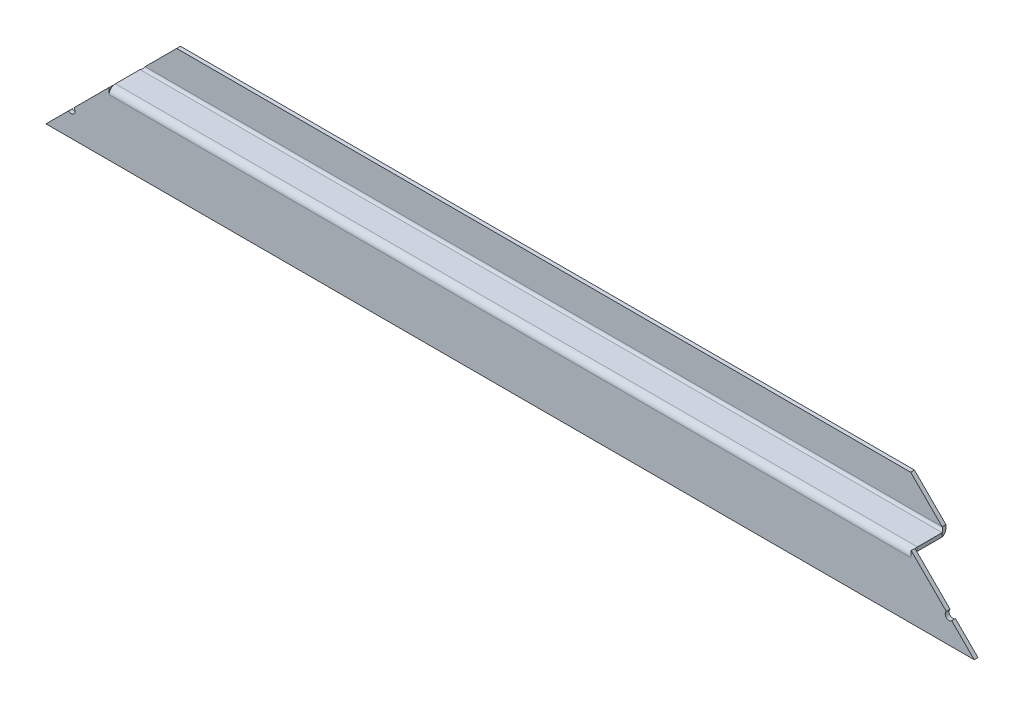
ISO-10303-21;
HEADER;
FILE_DESCRIPTION(('STEP AP214'),'2;1');
FILE_NAME('part.step','',(''),(''),'','','');
FILE_SCHEMA(('AUTOMOTIVE_DESIGN { 1 0 10303 214 1 1 1 1 }'));
ENDSEC;
DATA;
#1=APPLICATION_CONTEXT('core data for automotive mechanical design processes');
#2=APPLICATION_PROTOCOL_DEFINITION('international standard','automotive_design',2000,#1);
#3=PRODUCT_CONTEXT('',#1,'mechanical');
#4=PRODUCT('Part','Part','',(#3));
#5=PRODUCT_RELATED_PRODUCT_CATEGORY('part','',(#4));
#6=PRODUCT_DEFINITION_FORMATION('','',#4);
#7=PRODUCT_DEFINITION_CONTEXT('part definition',#1,'design');
#8=PRODUCT_DEFINITION('design','',#6,#7);
#9=PRODUCT_DEFINITION_SHAPE('','',#8);
#10=(LENGTH_UNIT() NAMED_UNIT(*) SI_UNIT(.MILLI.,.METRE.));
#11=(NAMED_UNIT(*) PLANE_ANGLE_UNIT() SI_UNIT($,.RADIAN.));
#12=(NAMED_UNIT(*) SI_UNIT($,.STERADIAN.) SOLID_ANGLE_UNIT());
#13=UNCERTAINTY_MEASURE_WITH_UNIT(LENGTH_MEASURE(1.E-05),#10,'distance_accuracy_value','');
#14=(GEOMETRIC_REPRESENTATION_CONTEXT(3) GLOBAL_UNCERTAINTY_ASSIGNED_CONTEXT((#13)) GLOBAL_UNIT_ASSIGNED_CONTEXT((#10,
#11,#12)) REPRESENTATION_CONTEXT('',''));
#15=CARTESIAN_POINT('',(0.,0.,0.));
#16=DIRECTION('',(0.,0.,1.));
#17=DIRECTION('',(1.,0.,0.));
#18=AXIS2_PLACEMENT_3D('',#15,#16,#17);
#19=CARTESIAN_POINT('',(-159.,-703.,1.5));
#20=DIRECTION('',(0.707106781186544,-0.707106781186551,0.));
#21=DIRECTION('',(0.707106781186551,0.707106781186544,0.));
#22=AXIS2_PLACEMENT_3D('',#19,#20,#21);
#23=PLANE('',#22);
#24=DIRECTION('',(-0.707106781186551,-0.707106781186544,0.));
#25=VECTOR('',#24,1.);
#26=CARTESIAN_POINT('',(-159.,-703.,0.));
#27=LINE('',#26,#25);
#28=CARTESIAN_POINT('',(-159.,-703.,0.));
#29=VERTEX_POINT('',#28);
#30=CARTESIAN_POINT('',(-172.93933982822,-716.93933982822,0.));
#31=VERTEX_POINT('',#30);
#32=EDGE_CURVE('E237',#29,#31,#27,.T.);
#33=ORIENTED_EDGE('',*,*,#32,.T.);
#34=DIRECTION('',(0.,0.,1.));
#35=VECTOR('',#34,1.);
#36=CARTESIAN_POINT('',(-172.93933982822,-716.93933982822,0.));
#37=LINE('',#36,#35);
#38=CARTESIAN_POINT('',(-172.93933982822,-716.93933982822,1.5));
#39=VERTEX_POINT('',#38);
#40=EDGE_CURVE('E13',#31,#39,#37,.T.);
#41=ORIENTED_EDGE('',*,*,#40,.T.);
#42=DIRECTION('',(-0.707106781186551,-0.707106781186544,0.));
#43=VECTOR('',#42,1.);
#44=CARTESIAN_POINT('',(-159.,-703.,1.5));
#45=LINE('',#44,#43);
#46=CARTESIAN_POINT('',(-159.,-703.,1.5));
#47=VERTEX_POINT('',#46);
#48=EDGE_CURVE('E233',#47,#39,#45,.T.);
#49=ORIENTED_EDGE('',*,*,#48,.F.);
#50=DIRECTION('',(0.,0.,-1.));
#51=VECTOR('',#50,1.);
#52=CARTESIAN_POINT('',(-159.,-703.,1.5));
#53=LINE('',#52,#51);
#54=EDGE_CURVE('E232',#47,#29,#53,.T.);
#55=ORIENTED_EDGE('',*,*,#54,.T.);
#56=EDGE_LOOP('',(#33,#41,#49,#55));
#57=FACE_BOUND('',#56,.T.);
#58=ADVANCED_FACE('F78',(#57),#23,.F.);
#59=CARTESIAN_POINT('',(158.999999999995,-703.,1.5));
#60=DIRECTION('',(-0.707106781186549,-0.707106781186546,0.));
#61=DIRECTION('',(0.707106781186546,-0.707106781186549,0.));
#62=AXIS2_PLACEMENT_3D('',#59,#60,#61);
#63=PLANE('',#62);
#64=DIRECTION('',(-0.707106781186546,0.707106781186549,0.));
#65=VECTOR('',#64,1.);
#66=CARTESIAN_POINT('',(158.999999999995,-703.,0.));
#67=LINE('',#66,#65);
#68=CARTESIAN_POINT('',(183.999999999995,-728.,0.));
#69=VERTEX_POINT('',#68);
#70=CARTESIAN_POINT('',(175.060660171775,-719.06066017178,0.));
#71=VERTEX_POINT('',#70);
#72=EDGE_CURVE('E244',#69,#71,#67,.T.);
#73=ORIENTED_EDGE('',*,*,#72,.T.);
#74=DIRECTION('',(0.,0.,1.));
#75=VECTOR('',#74,1.);
#76=CARTESIAN_POINT('',(175.060660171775,-719.06066017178,0.));
#77=LINE('',#76,#75);
#78=CARTESIAN_POINT('',(175.060660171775,-719.06066017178,1.5));
#79=VERTEX_POINT('',#78);
#80=EDGE_CURVE('E214',#71,#79,#77,.T.);
#81=ORIENTED_EDGE('',*,*,#80,.T.);
#82=DIRECTION('',(-0.707106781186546,0.707106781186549,0.));
#83=VECTOR('',#82,1.);
#84=CARTESIAN_POINT('',(158.999999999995,-703.,1.5));
#85=LINE('',#84,#83);
#86=CARTESIAN_POINT('',(183.999999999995,-728.,1.5));
#87=VERTEX_POINT('',#86);
#88=EDGE_CURVE('E224',#87,#79,#85,.T.);
#89=ORIENTED_EDGE('',*,*,#88,.F.);
#90=DIRECTION('',(0.,0.,-1.));
#91=VECTOR('',#90,1.);
#92=CARTESIAN_POINT('',(183.999999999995,-728.,1.5));
#93=LINE('',#92,#91);
#94=EDGE_CURVE('E251',#87,#69,#93,.T.);
#95=ORIENTED_EDGE('',*,*,#94,.T.);
#96=EDGE_LOOP('',(#73,#81,#89,#95));
#97=FACE_BOUND('',#96,.T.);
#98=ADVANCED_FACE('F282',(#97),#63,.F.);
#99=CARTESIAN_POINT('',(-159.,-703.,-13.3));
#100=DIRECTION('',(-1.,0.,0.));
#101=DIRECTION('',(0.,0.,1.));
#102=AXIS2_PLACEMENT_3D('',#99,#100,#101);
#103=PLANE('',#102);
#104=DIRECTION('',(0.,0.,-1.));
#105=VECTOR('',#104,1.);
#106=CARTESIAN_POINT('',(-159.,-703.,-13.3));
#107=LINE('',#106,#105);
#108=CARTESIAN_POINT('',(-159.,-703.,-1.));
#109=VERTEX_POINT('',#108);
#110=CARTESIAN_POINT('',(-159.,-703.,-10.8));
#111=VERTEX_POINT('',#110);
#112=EDGE_CURVE('E498',#109,#111,#107,.T.);
#113=ORIENTED_EDGE('',*,*,#112,.T.);
#114=DIRECTION('',(0.,-1.,0.));
#115=VECTOR('',#114,1.);
#116=CARTESIAN_POINT('',(-159.,-703.,-10.8));
#117=LINE('',#116,#115);
#118=CARTESIAN_POINT('',(-159.,-704.5,-10.8));
#119=VERTEX_POINT('',#118);
#120=EDGE_CURVE('E331',#111,#119,#117,.T.);
#121=ORIENTED_EDGE('',*,*,#120,.T.);
#122=DIRECTION('',(0.,0.,1.));
#123=VECTOR('',#122,1.);
#124=CARTESIAN_POINT('',(-159.,-704.5,0.));
#125=LINE('',#124,#123);
#126=CARTESIAN_POINT('',(-159.,-704.5,-1.));
#127=VERTEX_POINT('',#126);
#128=EDGE_CURVE('E495',#127,#119,#125,.F.);
#129=ORIENTED_EDGE('',*,*,#128,.F.);
#130=DIRECTION('',(0.,1.,0.));
#131=VECTOR('',#130,1.);
#132=CARTESIAN_POINT('',(-159.,-703.,-1.));
#133=LINE('',#132,#131);
#134=EDGE_CURVE('E330',#127,#109,#133,.T.);
#135=ORIENTED_EDGE('',*,*,#134,.T.);
#136=EDGE_LOOP('',(#113,#121,#129,#135));
#137=FACE_BOUND('',#136,.T.);
#138=ADVANCED_FACE('F395',(#137),#103,.T.);
#139=CARTESIAN_POINT('',(0.,-703.,0.));
#140=DIRECTION('',(0.,1.,0.));
#141=DIRECTION('',(0.,0.,1.));
#142=AXIS2_PLACEMENT_3D('',#139,#140,#141);
#143=PLANE('',#142);
#144=DIRECTION('',(0.,0.,1.));
#145=VECTOR('',#144,1.);
#146=CARTESIAN_POINT('',(158.999999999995,-703.,0.));
#147=LINE('',#146,#145);
#148=CARTESIAN_POINT('',(158.999999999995,-703.,-10.8));
#149=VERTEX_POINT('',#148);
#150=CARTESIAN_POINT('',(158.999999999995,-703.,-1.));
#151=VERTEX_POINT('',#150);
#152=EDGE_CURVE('E377',#149,#151,#147,.T.);
#153=ORIENTED_EDGE('',*,*,#152,.F.);
#154=DIRECTION('',(-1.,0.,0.));
#155=VECTOR('',#154,1.);
#156=CARTESIAN_POINT('',(-159.,-703.,-10.8));
#157=LINE('',#156,#155);
#158=EDGE_CURVE('E319',#111,#149,#157,.F.);
#159=ORIENTED_EDGE('',*,*,#158,.F.);
#160=ORIENTED_EDGE('',*,*,#112,.F.);
#161=DIRECTION('',(1.,0.,0.));
#162=VECTOR('',#161,1.);
#163=CARTESIAN_POINT('',(0.,-703.,-1.));
#164=LINE('',#163,#162);
#165=EDGE_CURVE('E464',#109,#151,#164,.T.);
#166=ORIENTED_EDGE('',*,*,#165,.T.);
#167=EDGE_LOOP('',(#153,#159,#160,#166));
#168=FACE_BOUND('',#167,.T.);
#169=ADVANCED_FACE('F385',(#168),#143,.T.);
#170=CARTESIAN_POINT('',(0.,-704.5,0.));
#171=DIRECTION('',(0.,1.,0.));
#172=DIRECTION('',(0.,0.,1.));
#173=AXIS2_PLACEMENT_3D('',#170,#171,#172);
#174=PLANE('',#173);
#175=DIRECTION('',(-1.,0.,0.));
#176=VECTOR('',#175,1.);
#177=CARTESIAN_POINT('',(-159.,-704.5,-10.8));
#178=LINE('',#177,#176);
#179=CARTESIAN_POINT('',(158.999999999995,-704.5,-10.8));
#180=VERTEX_POINT('',#179);
#181=EDGE_CURVE('E323',#119,#180,#178,.F.);
#182=ORIENTED_EDGE('',*,*,#181,.T.);
#183=DIRECTION('',(0.,0.,-1.));
#184=VECTOR('',#183,1.);
#185=CARTESIAN_POINT('',(158.999999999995,-704.5,0.));
#186=LINE('',#185,#184);
#187=CARTESIAN_POINT('',(158.999999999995,-704.5,-1.));
#188=VERTEX_POINT('',#187);
#189=EDGE_CURVE('E497',#180,#188,#186,.F.);
#190=ORIENTED_EDGE('',*,*,#189,.T.);
#191=DIRECTION('',(-1.,0.,0.));
#192=VECTOR('',#191,1.);
#193=CARTESIAN_POINT('',(-159.,-704.5,-1.));
#194=LINE('',#193,#192);
#195=EDGE_CURVE('E487',#127,#188,#194,.F.);
#196=ORIENTED_EDGE('',*,*,#195,.F.);
#197=ORIENTED_EDGE('',*,*,#128,.T.);
#198=EDGE_LOOP('',(#182,#190,#196,#197));
#199=FACE_BOUND('',#198,.T.);
#200=ADVANCED_FACE('F394',(#199),#174,.F.);
#201=CARTESIAN_POINT('',(158.999999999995,-703.,0.));
#202=DIRECTION('',(-1.,0.,0.));
#203=DIRECTION('',(0.,-1.,0.));
#204=AXIS2_PLACEMENT_3D('',#201,#202,#203);
#205=PLANE('',#204);
#206=DIRECTION('',(0.,-1.,0.));
#207=VECTOR('',#206,1.);
#208=CARTESIAN_POINT('',(158.999999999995,-703.,0.));
#209=LINE('',#208,#207);
#210=CARTESIAN_POINT('',(158.999999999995,-703.,0.));
#211=VERTEX_POINT('',#210);
#212=CARTESIAN_POINT('',(158.999999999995,-703.208712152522,0.));
#213=VERTEX_POINT('',#212);
#214=EDGE_CURVE('E271',#211,#213,#209,.T.);
#215=ORIENTED_EDGE('',*,*,#214,.T.);
#216=CARTESIAN_POINT('',(158.999999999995,-705.5,-1.));
#217=DIRECTION('',(1.,0.,0.));
#218=DIRECTION('',(0.,0.,-1.));
#219=AXIS2_PLACEMENT_3D('',#216,#217,#218);
#220=CIRCLE('',#219,2.5);
#221=CARTESIAN_POINT('',(158.999999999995,-705.5,1.5));
#222=VERTEX_POINT('',#221);
#223=EDGE_CURVE('E215',#213,#222,#220,.T.);
#224=ORIENTED_EDGE('',*,*,#223,.T.);
#225=DIRECTION('',(0.,-1.,0.));
#226=VECTOR('',#225,1.);
#227=CARTESIAN_POINT('',(158.999999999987,1.7652546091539E-12,1.5));
#228=LINE('',#227,#226);
#229=CARTESIAN_POINT('',(158.999999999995,-703.,1.5));
#230=VERTEX_POINT('',#229);
#231=EDGE_CURVE('E267',#230,#222,#228,.T.);
#232=ORIENTED_EDGE('',*,*,#231,.F.);
#233=DIRECTION('',(0.,0.,-1.));
#234=VECTOR('',#233,1.);
#235=CARTESIAN_POINT('',(158.999999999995,-703.,1.5));
#236=LINE('',#235,#234);
#237=EDGE_CURVE('E228',#230,#211,#236,.T.);
#238=ORIENTED_EDGE('',*,*,#237,.T.);
#239=EDGE_LOOP('',(#215,#224,#232,#238));
#240=FACE_BOUND('',#239,.T.);
#241=ADVANCED_FACE('F399',(#240),#205,.T.);
#242=CARTESIAN_POINT('',(-159.,-705.5,0.));
#243=DIRECTION('',(1.,0.,0.));
#244=DIRECTION('',(0.,0.,-1.));
#245=AXIS2_PLACEMENT_3D('',#242,#243,#244);
#246=PLANE('',#245);
#247=DIRECTION('',(0.,1.,0.));
#248=VECTOR('',#247,1.);
#249=CARTESIAN_POINT('',(-159.,0.,1.5));
#250=LINE('',#249,#248);
#251=CARTESIAN_POINT('',(-159.,-705.5,1.5));
#252=VERTEX_POINT('',#251);
#253=EDGE_CURVE('E268',#252,#47,#250,.T.);
#254=ORIENTED_EDGE('',*,*,#253,.F.);
#255=CARTESIAN_POINT('',(-159.,-705.5,-1.));
#256=DIRECTION('',(1.,0.,0.));
#257=DIRECTION('',(0.,0.,-1.));
#258=AXIS2_PLACEMENT_3D('',#255,#256,#257);
#259=CIRCLE('',#258,2.5);
#260=CARTESIAN_POINT('',(-159.,-703.208712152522,0.));
#261=VERTEX_POINT('',#260);
#262=EDGE_CURVE('E451',#252,#261,#259,.F.);
#263=ORIENTED_EDGE('',*,*,#262,.T.);
#264=DIRECTION('',(0.,1.,0.));
#265=VECTOR('',#264,1.);
#266=CARTESIAN_POINT('',(-159.,-705.5,0.));
#267=LINE('',#266,#265);
#268=EDGE_CURVE('E446',#261,#29,#267,.T.);
#269=ORIENTED_EDGE('',*,*,#268,.T.);
#270=ORIENTED_EDGE('',*,*,#54,.F.);
#271=EDGE_LOOP('',(#254,#263,#269,#270));
#272=FACE_BOUND('',#271,.T.);
#273=ADVANCED_FACE('F424',(#272),#246,.T.);
#274=CARTESIAN_POINT('',(0.,0.,1.5));
#275=DIRECTION('',(0.,0.,1.));
#276=DIRECTION('',(1.,0.,0.));
#277=AXIS2_PLACEMENT_3D('',#274,#275,#276);
#278=PLANE('',#277);
#279=CARTESIAN_POINT('',(173.999999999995,-718.,1.5));
#280=DIRECTION('',(0.,0.,1.));
#281=DIRECTION('',(1.,0.,0.));
#282=AXIS2_PLACEMENT_3D('',#279,#280,#281);
#283=CIRCLE('',#282,1.50000000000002);
#284=CARTESIAN_POINT('',(172.939339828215,-716.93933982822,1.5));
#285=VERTEX_POINT('',#284);
#286=EDGE_CURVE('E209',#285,#79,#283,.T.);
#287=ORIENTED_EDGE('',*,*,#286,.F.);
#288=EDGE_CURVE('E221',#285,#230,#85,.T.);
#289=ORIENTED_EDGE('',*,*,#288,.T.);
#290=ORIENTED_EDGE('',*,*,#231,.T.);
#291=DIRECTION('',(1.,0.,0.));
#292=VECTOR('',#291,1.);
#293=CARTESIAN_POINT('',(158.999999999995,-705.5,1.5));
#294=LINE('',#293,#292);
#295=EDGE_CURVE('E466',#222,#252,#294,.F.);
#296=ORIENTED_EDGE('',*,*,#295,.T.);
#297=ORIENTED_EDGE('',*,*,#253,.T.);
#298=ORIENTED_EDGE('',*,*,#48,.T.);
#299=CARTESIAN_POINT('',(-174.,-718.,1.5));
#300=DIRECTION('',(0.,0.,1.));
#301=DIRECTION('',(1.,0.,0.));
#302=AXIS2_PLACEMENT_3D('',#299,#300,#301);
#303=CIRCLE('',#302,1.5);
#304=CARTESIAN_POINT('',(-175.06066017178,-719.06066017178,1.5));
#305=VERTEX_POINT('',#304);
#306=EDGE_CURVE('E278',#305,#39,#303,.T.);
#307=ORIENTED_EDGE('',*,*,#306,.F.);
#308=CARTESIAN_POINT('',(-184.,-728.,1.5));
#309=VERTEX_POINT('',#308);
#310=EDGE_CURVE('E247',#305,#309,#45,.T.);
#311=ORIENTED_EDGE('',*,*,#310,.T.);
#312=DIRECTION('',(1.,0.,0.));
#313=VECTOR('',#312,1.);
#314=CARTESIAN_POINT('',(-184.,-728.,1.5));
#315=LINE('',#314,#313);
#316=EDGE_CURVE('E230',#309,#87,#315,.T.);
#317=ORIENTED_EDGE('',*,*,#316,.T.);
#318=ORIENTED_EDGE('',*,*,#88,.T.);
#319=EDGE_LOOP('',(#287,#289,#290,#296,#297,#298,#307,#311,#317,#318));
#320=FACE_BOUND('',#319,.T.);
#321=ADVANCED_FACE('F219',(#320),#278,.T.);
#322=CARTESIAN_POINT('',(0.,0.,0.));
#323=DIRECTION('',(0.,0.,1.));
#324=DIRECTION('',(1.,0.,0.));
#325=AXIS2_PLACEMENT_3D('',#322,#323,#324);
#326=PLANE('',#325);
#327=CARTESIAN_POINT('',(172.939339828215,-716.93933982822,0.));
#328=VERTEX_POINT('',#327);
#329=EDGE_CURVE('E243',#328,#211,#67,.T.);
#330=ORIENTED_EDGE('',*,*,#329,.F.);
#331=CARTESIAN_POINT('',(173.999999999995,-718.,0.));
#332=DIRECTION('',(0.,0.,1.));
#333=DIRECTION('',(1.,0.,0.));
#334=AXIS2_PLACEMENT_3D('',#331,#332,#333);
#335=CIRCLE('',#334,1.50000000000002);
#336=EDGE_CURVE('E101',#328,#71,#335,.T.);
#337=ORIENTED_EDGE('',*,*,#336,.T.);
#338=ORIENTED_EDGE('',*,*,#72,.F.);
#339=DIRECTION('',(1.,0.,0.));
#340=VECTOR('',#339,1.);
#341=CARTESIAN_POINT('',(-184.,-728.,0.));
#342=LINE('',#341,#340);
#343=CARTESIAN_POINT('',(-184.,-728.,0.));
#344=VERTEX_POINT('',#343);
#345=EDGE_CURVE('E240',#344,#69,#342,.T.);
#346=ORIENTED_EDGE('',*,*,#345,.F.);
#347=CARTESIAN_POINT('',(-175.06066017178,-719.06066017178,0.));
#348=VERTEX_POINT('',#347);
#349=EDGE_CURVE('E241',#348,#344,#27,.T.);
#350=ORIENTED_EDGE('',*,*,#349,.F.);
#351=CARTESIAN_POINT('',(-174.,-718.,0.));
#352=DIRECTION('',(0.,0.,1.));
#353=DIRECTION('',(1.,0.,0.));
#354=AXIS2_PLACEMENT_3D('',#351,#352,#353);
#355=CIRCLE('',#354,1.5);
#356=EDGE_CURVE('E93',#348,#31,#355,.T.);
#357=ORIENTED_EDGE('',*,*,#356,.T.);
#358=ORIENTED_EDGE('',*,*,#32,.F.);
#359=ORIENTED_EDGE('',*,*,#268,.F.);
#360=CARTESIAN_POINT('',(-159.,-705.5,0.));
#361=VERTEX_POINT('',#360);
#362=EDGE_CURVE('E449',#361,#261,#267,.T.);
#363=ORIENTED_EDGE('',*,*,#362,.F.);
#364=DIRECTION('',(1.,0.,0.));
#365=VECTOR('',#364,1.);
#366=CARTESIAN_POINT('',(158.999999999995,-705.5,0.));
#367=LINE('',#366,#365);
#368=CARTESIAN_POINT('',(158.999999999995,-705.5,0.));
#369=VERTEX_POINT('',#368);
#370=EDGE_CURVE('E474',#369,#361,#367,.F.);
#371=ORIENTED_EDGE('',*,*,#370,.F.);
#372=EDGE_CURVE('E461',#213,#369,#209,.T.);
#373=ORIENTED_EDGE('',*,*,#372,.F.);
#374=ORIENTED_EDGE('',*,*,#214,.F.);
#375=EDGE_LOOP('',(#330,#337,#338,#346,#350,#357,#358,#359,#363,#371,#373,#374));
#376=FACE_BOUND('',#375,.T.);
#377=ADVANCED_FACE('F264',(#376),#326,.F.);
#378=ORIENTED_EDGE('',*,*,#310,.F.);
#379=DIRECTION('',(0.,0.,1.));
#380=VECTOR('',#379,1.);
#381=CARTESIAN_POINT('',(-175.06066017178,-719.06066017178,0.));
#382=LINE('',#381,#380);
#383=EDGE_CURVE('E86',#305,#348,#382,.F.);
#384=ORIENTED_EDGE('',*,*,#383,.T.);
#385=ORIENTED_EDGE('',*,*,#349,.T.);
#386=DIRECTION('',(0.,0.,-1.));
#387=VECTOR('',#386,1.);
#388=CARTESIAN_POINT('',(-184.,-728.,1.5));
#389=LINE('',#388,#387);
#390=EDGE_CURVE('E254',#309,#344,#389,.T.);
#391=ORIENTED_EDGE('',*,*,#390,.F.);
#392=EDGE_LOOP('',(#378,#384,#385,#391));
#393=FACE_BOUND('',#392,.T.);
#394=ADVANCED_FACE('F80',(#393),#23,.F.);
#395=CARTESIAN_POINT('',(-184.,-728.,1.5));
#396=DIRECTION('',(0.,1.,0.));
#397=DIRECTION('',(0.,0.,1.));
#398=AXIS2_PLACEMENT_3D('',#395,#396,#397);
#399=PLANE('',#398);
#400=ORIENTED_EDGE('',*,*,#345,.T.);
#401=ORIENTED_EDGE('',*,*,#94,.F.);
#402=ORIENTED_EDGE('',*,*,#316,.F.);
#403=ORIENTED_EDGE('',*,*,#390,.T.);
#404=EDGE_LOOP('',(#400,#401,#402,#403));
#405=FACE_BOUND('',#404,.T.);
#406=ADVANCED_FACE('F280',(#405),#399,.F.);
#407=ORIENTED_EDGE('',*,*,#288,.F.);
#408=DIRECTION('',(0.,0.,1.));
#409=VECTOR('',#408,1.);
#410=CARTESIAN_POINT('',(172.939339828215,-716.93933982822,0.));
#411=LINE('',#410,#409);
#412=EDGE_CURVE('E206',#285,#328,#411,.F.);
#413=ORIENTED_EDGE('',*,*,#412,.T.);
#414=ORIENTED_EDGE('',*,*,#329,.T.);
#415=ORIENTED_EDGE('',*,*,#237,.F.);
#416=EDGE_LOOP('',(#407,#413,#414,#415));
#417=FACE_BOUND('',#416,.T.);
#418=ADVANCED_FACE('F226',(#417),#63,.F.);
#419=CARTESIAN_POINT('',(-159.,-705.5,-1.));
#420=DIRECTION('',(-1.,0.,0.));
#421=DIRECTION('',(0.,0.,1.));
#422=AXIS2_PLACEMENT_3D('',#419,#420,#421);
#423=PLANE('',#422);
#424=CARTESIAN_POINT('',(-159.,-705.5,-1.));
#425=DIRECTION('',(1.,0.,0.));
#426=DIRECTION('',(0.,0.,-1.));
#427=AXIS2_PLACEMENT_3D('',#424,#425,#426);
#428=CIRCLE('',#427,1.);
#429=EDGE_CURVE('E460',#361,#127,#428,.F.);
#430=ORIENTED_EDGE('',*,*,#429,.F.);
#431=ORIENTED_EDGE('',*,*,#362,.T.);
#432=EDGE_CURVE('E455',#261,#109,#259,.F.);
#433=ORIENTED_EDGE('',*,*,#432,.T.);
#434=ORIENTED_EDGE('',*,*,#134,.F.);
#435=EDGE_LOOP('',(#430,#431,#433,#434));
#436=FACE_BOUND('',#435,.T.);
#437=ADVANCED_FACE('F417',(#436),#423,.T.);
#438=CARTESIAN_POINT('',(158.999999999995,-705.5,-1.));
#439=DIRECTION('',(-1.,0.,0.));
#440=DIRECTION('',(0.,0.,1.));
#441=AXIS2_PLACEMENT_3D('',#438,#439,#440);
#442=PLANE('',#441);
#443=EDGE_CURVE('E467',#151,#213,#220,.T.);
#444=ORIENTED_EDGE('',*,*,#443,.T.);
#445=ORIENTED_EDGE('',*,*,#372,.T.);
#446=CARTESIAN_POINT('',(158.999999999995,-705.5,-1.));
#447=DIRECTION('',(1.,0.,0.));
#448=DIRECTION('',(0.,0.,-1.));
#449=AXIS2_PLACEMENT_3D('',#446,#447,#448);
#450=CIRCLE('',#449,1.);
#451=EDGE_CURVE('E476',#188,#369,#450,.T.);
#452=ORIENTED_EDGE('',*,*,#451,.F.);
#453=DIRECTION('',(0.,1.,0.));
#454=VECTOR('',#453,1.);
#455=CARTESIAN_POINT('',(158.999999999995,-704.5,-1.));
#456=LINE('',#455,#454);
#457=EDGE_CURVE('E490',#188,#151,#456,.T.);
#458=ORIENTED_EDGE('',*,*,#457,.T.);
#459=EDGE_LOOP('',(#444,#445,#452,#458));
#460=FACE_BOUND('',#459,.T.);
#461=ADVANCED_FACE('F412',(#460),#442,.F.);
#462=CARTESIAN_POINT('',(158.999999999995,-705.5,-1.));
#463=DIRECTION('',(1.,0.,0.));
#464=DIRECTION('',(0.,1.,0.));
#465=AXIS2_PLACEMENT_3D('',#462,#463,#464);
#466=CYLINDRICAL_SURFACE('',#465,2.5);
#467=ORIENTED_EDGE('',*,*,#295,.F.);
#468=ORIENTED_EDGE('',*,*,#223,.F.);
#469=ORIENTED_EDGE('',*,*,#443,.F.);
#470=ORIENTED_EDGE('',*,*,#165,.F.);
#471=ORIENTED_EDGE('',*,*,#432,.F.);
#472=ORIENTED_EDGE('',*,*,#262,.F.);
#473=EDGE_LOOP('',(#467,#468,#469,#470,#471,#472));
#474=FACE_BOUND('',#473,.T.);
#475=ADVANCED_FACE('F409',(#474),#466,.T.);
#476=CARTESIAN_POINT('',(158.999999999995,-705.5,-1.));
#477=DIRECTION('',(1.,0.,0.));
#478=DIRECTION('',(0.,1.,0.));
#479=AXIS2_PLACEMENT_3D('',#476,#477,#478);
#480=CYLINDRICAL_SURFACE('',#479,1.);
#481=ORIENTED_EDGE('',*,*,#370,.T.);
#482=ORIENTED_EDGE('',*,*,#429,.T.);
#483=ORIENTED_EDGE('',*,*,#195,.T.);
#484=ORIENTED_EDGE('',*,*,#451,.T.);
#485=EDGE_LOOP('',(#481,#482,#483,#484));
#486=FACE_BOUND('',#485,.T.);
#487=ADVANCED_FACE('F404',(#486),#480,.F.);
#488=CARTESIAN_POINT('',(158.999999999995,-703.,0.));
#489=DIRECTION('',(1.,0.,0.));
#490=DIRECTION('',(0.,0.,-1.));
#491=AXIS2_PLACEMENT_3D('',#488,#489,#490);
#492=PLANE('',#491);
#493=DIRECTION('',(0.,-1.,0.));
#494=VECTOR('',#493,1.);
#495=CARTESIAN_POINT('',(158.999999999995,-703.,-10.8));
#496=LINE('',#495,#494);
#497=EDGE_CURVE('E327',#149,#180,#496,.T.);
#498=ORIENTED_EDGE('',*,*,#497,.F.);
#499=ORIENTED_EDGE('',*,*,#152,.T.);
#500=ORIENTED_EDGE('',*,*,#457,.F.);
#501=ORIENTED_EDGE('',*,*,#189,.F.);
#502=EDGE_LOOP('',(#498,#499,#500,#501));
#503=FACE_BOUND('',#502,.T.);
#504=ADVANCED_FACE('F401',(#503),#492,.T.);
#505=CARTESIAN_POINT('',(158.999999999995,-704.515,-10.8));
#506=CARTESIAN_POINT('',(158.916652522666,-704.515,-11.1292685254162));
#507=CARTESIAN_POINT('',(158.833333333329,-704.449541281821,-11.4582959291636));
#508=CARTESIAN_POINT('',(158.666666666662,-704.197572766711,-12.0666017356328));
#509=CARTESIAN_POINT('',(158.583333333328,-704.011162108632,-12.3455850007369));
#510=CARTESIAN_POINT('',(158.416666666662,-703.545585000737,-12.8111621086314));
#511=CARTESIAN_POINT('',(158.333333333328,-703.266601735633,-12.9975727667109));
#512=CARTESIAN_POINT('',(158.166666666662,-702.658295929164,-13.2495412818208));
#513=CARTESIAN_POINT('',(158.083347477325,-702.329268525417,-13.315));
#514=CARTESIAN_POINT('',(157.999999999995,-702.,-13.315));
#515=CARTESIAN_POINT('',(158.999999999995,-704.5,-10.8));
#516=CARTESIAN_POINT('',(158.916652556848,-704.5,-11.1273046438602));
#517=CARTESIAN_POINT('',(158.833333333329,-704.434931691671,-11.4543697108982));
#518=CARTESIAN_POINT('',(158.666666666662,-704.184465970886,-12.0590474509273));
#519=CARTESIAN_POINT('',(158.583333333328,-703.999167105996,-12.3363667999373));
#520=CARTESIAN_POINT('',(158.416666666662,-703.536366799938,-12.7991671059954));
#521=CARTESIAN_POINT('',(158.333333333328,-703.259047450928,-12.9844659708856));
#522=CARTESIAN_POINT('',(158.166666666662,-702.654369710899,-13.2349316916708));
#523=CARTESIAN_POINT('',(158.083347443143,-702.327304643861,-13.3));
#524=CARTESIAN_POINT('',(157.999999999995,-702.,-13.3));
#525=CARTESIAN_POINT('',(158.999999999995,-703.,-10.8));
#526=CARTESIAN_POINT('',(158.91665597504,-703.,-10.93091648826));
#527=CARTESIAN_POINT('',(158.833333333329,-702.973972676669,-11.0617478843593));
#528=CARTESIAN_POINT('',(158.666666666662,-702.873786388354,-11.3036189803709));
#529=CARTESIAN_POINT('',(158.583333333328,-702.799666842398,-11.4145467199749));
#530=CARTESIAN_POINT('',(158.416666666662,-702.614546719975,-11.5996668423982));
#531=CARTESIAN_POINT('',(158.333333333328,-702.503618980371,-11.6737863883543));
#532=CARTESIAN_POINT('',(158.166666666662,-702.26174788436,-11.7739726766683));
#533=CARTESIAN_POINT('',(158.08334402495,-702.13091648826,-11.8));
#534=CARTESIAN_POINT('',(157.999999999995,-702.,-11.8));
#535=CARTESIAN_POINT('',(158.999999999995,-702.98485,-10.8));
#536=CARTESIAN_POINT('',(158.916656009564,-702.98485,-10.9289329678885));
#537=CARTESIAN_POINT('',(158.833333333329,-702.959216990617,-11.0577824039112));
#538=CARTESIAN_POINT('',(158.666666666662,-702.860548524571,-11.2959891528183));
#539=CARTESIAN_POINT('',(158.583333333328,-702.787551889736,-11.4052363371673));
#540=CARTESIAN_POINT('',(158.416666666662,-702.605236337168,-11.5875518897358));
#541=CARTESIAN_POINT('',(158.333333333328,-702.495989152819,-11.6605485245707));
#542=CARTESIAN_POINT('',(158.166666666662,-702.257782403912,-11.7592169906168));
#543=CARTESIAN_POINT('',(158.083343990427,-702.128932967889,-11.78485));
#544=CARTESIAN_POINT('',(157.999999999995,-702.,-11.78485));
#545=B_SPLINE_SURFACE_WITH_KNOTS('',1,3,((#505,#506,#507,#508,#509,#510,#511,#512,#513,#514),
(#515,#516,#517,#518,#519,#520,#521,#522,#523,#524),(#525,#526,#527,#528,#529,#530,#531,#532,
#533,#534),(#535,#536,#537,#538,#539,#540,#541,#542,#543,#544)),.UNSPECIFIED.,.F.,.F.,.F.,(2,1,
1,2),(4,2,2,2,4),(-0.01,0.,1.,1.0101),(0.,0.25,0.5,0.75,1.),.UNSPECIFIED.);
#546=DIRECTION('',(0.,0.,1.));
#547=VECTOR('',#546,1.);
#548=CARTESIAN_POINT('',(157.999999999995,-702.,-13.3));
#549=LINE('',#548,#547);
#550=CARTESIAN_POINT('',(157.999999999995,-702.,-11.8));
#551=VERTEX_POINT('',#550);
#552=CARTESIAN_POINT('',(157.999999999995,-702.,-13.3));
#553=VERTEX_POINT('',#552);
#554=EDGE_CURVE('E284',#551,#553,#549,.F.);
#555=CARTESIAN_POINT('',(158.999999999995,-703.,-10.8));
#556=CARTESIAN_POINT('',(158.977104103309,-703.000007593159,-10.8359623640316));
#557=CARTESIAN_POINT('',(158.954210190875,-702.998060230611,-10.8719230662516));
#558=CARTESIAN_POINT('',(158.908423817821,-702.990312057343,-10.9434269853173));
#559=CARTESIAN_POINT('',(158.885531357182,-702.984511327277,-10.9789702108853));
#560=CARTESIAN_POINT('',(158.839778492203,-702.969124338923,-11.0491742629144));
#561=CARTESIAN_POINT('',(158.816918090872,-702.959543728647,-11.0838363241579));
#562=CARTESIAN_POINT('',(158.771204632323,-702.936720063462,-11.1519180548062));
#563=CARTESIAN_POINT('',(158.748351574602,-702.923477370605,-11.1853378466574));
#564=CARTESIAN_POINT('',(158.682999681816,-702.88056471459,-11.2785905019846));
#565=CARTESIAN_POINT('',(158.640473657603,-702.846550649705,-11.3364749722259));
#566=CARTESIAN_POINT('',(158.55546427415,-702.767722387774,-11.4442546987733));
#567=CARTESIAN_POINT('',(158.512980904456,-702.722914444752,-11.4941545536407));
#568=CARTESIAN_POINT('',(158.428015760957,-702.62426999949,-11.5840518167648));
#569=CARTESIAN_POINT('',(158.385533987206,-702.570434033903,-11.624049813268));
#570=CARTESIAN_POINT('',(158.300550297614,-702.455859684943,-11.6925518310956));
#571=CARTESIAN_POINT('',(158.258048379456,-702.395119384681,-11.7210526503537));
#572=CARTESIAN_POINT('',(158.179615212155,-702.278913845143,-11.7619730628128));
#573=CARTESIAN_POINT('',(158.143680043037,-702.224076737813,-11.7761932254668));
#574=CARTESIAN_POINT('',(158.071833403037,-702.112834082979,-11.7952253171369));
#575=CARTESIAN_POINT('',(158.035921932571,-702.056429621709,-11.8000436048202));
#576=CARTESIAN_POINT('',(157.999999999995,-702.,-11.8));
#577=B_SPLINE_CURVE_WITH_KNOTS('',3,(#555,#556,#557,#558,#559,#560,#561,#562,#563,#564,#565,
#566,#567,#568,#569,#570,#571,#572,#573,#574,#575,#576),.UNSPECIFIED.,.F.,.F.,(4,2,2,2,2,2,2,2,
2,2,4),(0.,0.127848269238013,0.25569386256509,0.383349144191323,0.51099180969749,
0.748186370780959,0.985243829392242,1.22228720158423,1.45939654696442,1.65999150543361,
1.86045075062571),.UNSPECIFIED.);
#578=EDGE_CURVE('E322',#149,#551,#577,.T.);
#579=CARTESIAN_POINT('',(158.999999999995,-704.5,-10.8));
#580=CARTESIAN_POINT('',(158.984225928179,-704.500000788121,-10.8619420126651));
#581=CARTESIAN_POINT('',(158.968456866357,-704.497697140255,-10.9238648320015));
#582=CARTESIAN_POINT('',(158.936921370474,-704.48850298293,-11.0473606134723));
#583=CARTESIAN_POINT('',(158.921154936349,-704.481613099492,-11.1089336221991));
#584=CARTESIAN_POINT('',(158.873848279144,-704.454099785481,-11.2926620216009));
#585=CARTESIAN_POINT('',(158.842294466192,-704.426632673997,-11.4138515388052));
#586=CARTESIAN_POINT('',(158.773795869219,-704.347834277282,-11.6710428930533));
#587=CARTESIAN_POINT('',(158.736849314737,-704.293232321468,-11.80604666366));
#588=CARTESIAN_POINT('',(158.662960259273,-704.161466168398,-12.0645614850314));
#589=CARTESIAN_POINT('',(158.626017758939,-704.084299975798,-12.1880715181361));
#590=CARTESIAN_POINT('',(158.552129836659,-703.909744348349,-12.4198530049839));
#591=CARTESIAN_POINT('',(158.51518441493,-703.812355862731,-12.5281251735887));
#592=CARTESIAN_POINT('',(158.441290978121,-703.60027978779,-12.7261761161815));
#593=CARTESIAN_POINT('',(158.404342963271,-703.485590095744,-12.8159526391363));
#594=CARTESIAN_POINT('',(158.330441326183,-703.24237950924,-12.9742957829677));
#595=CARTESIAN_POINT('',(158.293487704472,-703.11385561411,-13.0428577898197));
#596=CARTESIAN_POINT('',(158.219587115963,-702.846895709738,-13.15664808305));
#597=CARTESIAN_POINT('',(158.182640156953,-702.708465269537,-13.2018893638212));
#598=CARTESIAN_POINT('',(158.121409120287,-702.474281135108,-13.2564586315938));
#599=CARTESIAN_POINT('',(158.097110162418,-702.380100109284,-13.272775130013));
#600=CARTESIAN_POINT('',(158.048545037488,-702.190625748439,-13.2945452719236));
#601=CARTESIAN_POINT('',(158.024278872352,-702.095334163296,-13.3000141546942));
#602=CARTESIAN_POINT('',(157.999999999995,-702.,-13.3));
#603=B_SPLINE_CURVE_WITH_KNOTS('',3,(#579,#580,#581,#582,#583,#584,#585,#586,#587,#588,#589,
#590,#591,#592,#593,#594,#595,#596,#597,#598,#599,#600,#601,#602),.UNSPECIFIED.,.F.,.F.,(4,2,2,
2,2,2,2,2,2,2,2,4),(0.,0.191675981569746,0.383325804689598,0.766549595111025,1.21512109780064,
1.66373227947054,2.1123224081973,2.56096710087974,3.00970930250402,3.45820119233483,
3.75350969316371,4.04840303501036),.UNSPECIFIED.);
#604=EDGE_CURVE('E325',#180,#553,#603,.T.);
#605=ORIENTED_EDGE('',*,*,#554,.F.);
#606=ORIENTED_EDGE('',*,*,#578,.F.);
#607=ORIENTED_EDGE('',*,*,#497,.T.);
#608=ORIENTED_EDGE('',*,*,#604,.T.);
#609=EDGE_LOOP('',(#605,#606,#607,#608));
#610=FACE_BOUND('',#609,.T.);
#611=ADVANCED_FACE('F347',(#610),#545,.F.);
#612=CARTESIAN_POINT('',(-158.,-702.,-13.315));
#613=CARTESIAN_POINT('',(-158.08334747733,-702.329268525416,-13.315));
#614=CARTESIAN_POINT('',(-158.166666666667,-702.658295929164,-13.2495412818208));
#615=CARTESIAN_POINT('',(-158.333333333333,-703.266601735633,-12.9975727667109));
#616=CARTESIAN_POINT('',(-158.416666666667,-703.545585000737,-12.8111621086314));
#617=CARTESIAN_POINT('',(-158.583333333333,-704.011162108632,-12.3455850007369));
#618=CARTESIAN_POINT('',(-158.666666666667,-704.197572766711,-12.0666017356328));
#619=CARTESIAN_POINT('',(-158.833333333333,-704.449541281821,-11.4582959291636));
#620=CARTESIAN_POINT('',(-158.916652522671,-704.515,-11.1292685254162));
#621=CARTESIAN_POINT('',(-159.,-704.515,-10.8));
#622=CARTESIAN_POINT('',(-158.,-702.,-13.3));
#623=CARTESIAN_POINT('',(-158.083347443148,-702.32730464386,-13.3));
#624=CARTESIAN_POINT('',(-158.166666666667,-702.654369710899,-13.2349316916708));
#625=CARTESIAN_POINT('',(-158.333333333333,-703.259047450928,-12.9844659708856));
#626=CARTESIAN_POINT('',(-158.416666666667,-703.536366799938,-12.7991671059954));
#627=CARTESIAN_POINT('',(-158.583333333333,-703.999167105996,-12.3363667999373));
#628=CARTESIAN_POINT('',(-158.666666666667,-704.184465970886,-12.0590474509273));
#629=CARTESIAN_POINT('',(-158.833333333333,-704.434931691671,-11.4543697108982));
#630=CARTESIAN_POINT('',(-158.916652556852,-704.5,-11.1273046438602));
#631=CARTESIAN_POINT('',(-159.,-704.5,-10.8));
#632=CARTESIAN_POINT('',(-158.,-702.,-11.8));
#633=CARTESIAN_POINT('',(-158.083344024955,-702.13091648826,-11.8));
#634=CARTESIAN_POINT('',(-158.166666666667,-702.26174788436,-11.7739726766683));
#635=CARTESIAN_POINT('',(-158.333333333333,-702.503618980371,-11.6737863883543));
#636=CARTESIAN_POINT('',(-158.416666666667,-702.614546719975,-11.5996668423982));
#637=CARTESIAN_POINT('',(-158.583333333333,-702.799666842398,-11.4145467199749));
#638=CARTESIAN_POINT('',(-158.666666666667,-702.873786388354,-11.3036189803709));
#639=CARTESIAN_POINT('',(-158.833333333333,-702.973972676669,-11.0617478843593));
#640=CARTESIAN_POINT('',(-158.916655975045,-703.,-10.93091648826));
#641=CARTESIAN_POINT('',(-159.,-703.,-10.8));
#642=CARTESIAN_POINT('',(-158.,-702.,-11.78485));
#643=CARTESIAN_POINT('',(-158.083343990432,-702.128932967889,-11.78485));
#644=CARTESIAN_POINT('',(-158.166666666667,-702.257782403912,-11.7592169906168));
#645=CARTESIAN_POINT('',(-158.333333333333,-702.495989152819,-11.6605485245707));
#646=CARTESIAN_POINT('',(-158.416666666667,-702.605236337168,-11.5875518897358));
#647=CARTESIAN_POINT('',(-158.583333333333,-702.787551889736,-11.4052363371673));
#648=CARTESIAN_POINT('',(-158.666666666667,-702.860548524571,-11.2959891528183));
#649=CARTESIAN_POINT('',(-158.833333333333,-702.959216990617,-11.0577824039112));
#650=CARTESIAN_POINT('',(-158.916656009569,-702.98485,-10.9289329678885));
#651=CARTESIAN_POINT('',(-159.,-702.98485,-10.8));
#652=B_SPLINE_SURFACE_WITH_KNOTS('',1,3,((#612,#613,#614,#615,#616,#617,#618,#619,#620,#621),
(#622,#623,#624,#625,#626,#627,#628,#629,#630,#631),(#632,#633,#634,#635,#636,#637,#638,#639,
#640,#641),(#642,#643,#644,#645,#646,#647,#648,#649,#650,#651)),.UNSPECIFIED.,.F.,.F.,.F.,(2,1,
1,2),(4,2,2,2,4),(-0.01,0.,1.,1.0101),(0.,0.25,0.5,0.75,1.),.UNSPECIFIED.);
#653=CARTESIAN_POINT('',(-158.,-702.,-11.8));
#654=CARTESIAN_POINT('',(-158.022895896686,-702.035962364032,-11.8000075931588));
#655=CARTESIAN_POINT('',(-158.045789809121,-702.071923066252,-11.7980602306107));
#656=CARTESIAN_POINT('',(-158.091576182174,-702.143426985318,-11.7903120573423));
#657=CARTESIAN_POINT('',(-158.114468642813,-702.178970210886,-11.7845113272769));
#658=CARTESIAN_POINT('',(-158.160221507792,-702.249174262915,-11.7691243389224));
#659=CARTESIAN_POINT('',(-158.183081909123,-702.283836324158,-11.7595437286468));
#660=CARTESIAN_POINT('',(-158.228795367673,-702.351918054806,-11.7367200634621));
#661=CARTESIAN_POINT('',(-158.251648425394,-702.385337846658,-11.7234773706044));
#662=CARTESIAN_POINT('',(-158.317000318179,-702.478590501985,-11.6805647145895));
#663=CARTESIAN_POINT('',(-158.359526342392,-702.536474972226,-11.6465506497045));
#664=CARTESIAN_POINT('',(-158.444535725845,-702.644254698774,-11.5677223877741));
#665=CARTESIAN_POINT('',(-158.487019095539,-702.694154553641,-11.5229144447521));
#666=CARTESIAN_POINT('',(-158.571984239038,-702.784051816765,-11.4242699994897));
#667=CARTESIAN_POINT('',(-158.614466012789,-702.824049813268,-11.3704340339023));
#668=CARTESIAN_POINT('',(-158.699449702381,-702.892551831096,-11.2558596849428));
#669=CARTESIAN_POINT('',(-158.741951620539,-702.921052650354,-11.1951193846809));
#670=CARTESIAN_POINT('',(-158.82038478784,-702.961973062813,-11.0789138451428));
#671=CARTESIAN_POINT('',(-158.856319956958,-702.976193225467,-11.024076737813));
#672=CARTESIAN_POINT('',(-158.928166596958,-702.995225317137,-10.9128340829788));
#673=CARTESIAN_POINT('',(-158.964078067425,-703.00004360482,-10.8564296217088));
#674=CARTESIAN_POINT('',(-159.,-703.,-10.8));
#675=B_SPLINE_CURVE_WITH_KNOTS('',3,(#653,#654,#655,#656,#657,#658,#659,#660,#661,#662,#663,
#664,#665,#666,#667,#668,#669,#670,#671,#672,#673,#674),.UNSPECIFIED.,.F.,.F.,(4,2,2,2,2,2,2,2,
2,2,4),(0.,0.127848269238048,0.255693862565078,0.383349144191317,0.510991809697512,
0.74818637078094,0.985243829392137,1.22228720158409,1.45939654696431,1.65999150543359,
1.86045075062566),.UNSPECIFIED.);
#676=CARTESIAN_POINT('',(-158.,-702.,-11.8));
#677=VERTEX_POINT('',#676);
#678=EDGE_CURVE('E295',#677,#111,#675,.T.);
#679=DIRECTION('',(0.,0.,1.));
#680=VECTOR('',#679,1.);
#681=CARTESIAN_POINT('',(-158.,-702.,-11.8000000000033));
#682=LINE('',#681,#680);
#683=CARTESIAN_POINT('',(-158.,-702.,-13.3));
#684=VERTEX_POINT('',#683);
#685=EDGE_CURVE('E315',#677,#684,#682,.F.);
#686=CARTESIAN_POINT('',(-158.,-702.,-13.3));
#687=CARTESIAN_POINT('',(-158.015774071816,-702.061942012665,-13.3000007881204));
#688=CARTESIAN_POINT('',(-158.031543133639,-702.123864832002,-13.2976971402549));
#689=CARTESIAN_POINT('',(-158.063078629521,-702.247360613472,-13.2885029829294));
#690=CARTESIAN_POINT('',(-158.078845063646,-702.308933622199,-13.2816130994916));
#691=CARTESIAN_POINT('',(-158.126151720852,-702.492662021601,-13.2540997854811));
#692=CARTESIAN_POINT('',(-158.157705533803,-702.613851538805,-13.2266326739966));
#693=CARTESIAN_POINT('',(-158.226204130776,-702.871042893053,-13.1478342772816));
#694=CARTESIAN_POINT('',(-158.263150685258,-703.00604666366,-13.0932323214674));
#695=CARTESIAN_POINT('',(-158.337039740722,-703.264561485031,-12.9614661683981));
#696=CARTESIAN_POINT('',(-158.373982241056,-703.388071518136,-12.8842999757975));
#697=CARTESIAN_POINT('',(-158.447870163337,-703.619853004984,-12.7097443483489));
#698=CARTESIAN_POINT('',(-158.484815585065,-703.728125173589,-12.6123558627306));
#699=CARTESIAN_POINT('',(-158.558709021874,-703.926176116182,-12.4002797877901));
#700=CARTESIAN_POINT('',(-158.595657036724,-704.015952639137,-12.285590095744));
#701=CARTESIAN_POINT('',(-158.669558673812,-704.174295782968,-12.0423795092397));
#702=CARTESIAN_POINT('',(-158.706512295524,-704.24285778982,-11.9138556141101));
#703=CARTESIAN_POINT('',(-158.780412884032,-704.35664808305,-11.6468957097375));
#704=CARTESIAN_POINT('',(-158.817359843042,-704.401889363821,-11.5084652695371));
#705=CARTESIAN_POINT('',(-158.878590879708,-704.456458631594,-11.2742811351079));
#706=CARTESIAN_POINT('',(-158.902889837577,-704.472775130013,-11.1801001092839));
#707=CARTESIAN_POINT('',(-158.951454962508,-704.494545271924,-10.9906257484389));
#708=CARTESIAN_POINT('',(-158.975721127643,-704.500014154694,-10.8953341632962));
#709=CARTESIAN_POINT('',(-159.,-704.5,-10.8));
#710=B_SPLINE_CURVE_WITH_KNOTS('',3,(#686,#687,#688,#689,#690,#691,#692,#693,#694,#695,#696,
#697,#698,#699,#700,#701,#702,#703,#704,#705,#706,#707,#708,#709),.UNSPECIFIED.,.F.,.F.,(4,2,2,
2,2,2,2,2,2,2,2,4),(0.,0.19167598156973,0.383325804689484,0.76654959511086,1.21512109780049,
1.66373227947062,2.11232240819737,2.56096710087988,3.00970930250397,3.45820119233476,
3.75350969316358,4.04840303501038),.UNSPECIFIED.);
#711=EDGE_CURVE('E326',#684,#119,#710,.T.);
#712=ORIENTED_EDGE('',*,*,#678,.F.);
#713=ORIENTED_EDGE('',*,*,#685,.T.);
#714=ORIENTED_EDGE('',*,*,#711,.T.);
#715=ORIENTED_EDGE('',*,*,#120,.F.);
#716=EDGE_LOOP('',(#712,#713,#714,#715));
#717=FACE_BOUND('',#716,.T.);
#718=ADVANCED_FACE('F357',(#717),#652,.F.);
#719=CARTESIAN_POINT('',(-159.,-702.,-10.8));
#720=DIRECTION('',(-1.,0.,0.));
#721=DIRECTION('',(0.,0.,-1.));
#722=AXIS2_PLACEMENT_3D('',#719,#720,#721);
#723=CYLINDRICAL_SURFACE('',#722,2.50000000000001);
#724=ORIENTED_EDGE('',*,*,#181,.F.);
#725=ORIENTED_EDGE('',*,*,#711,.F.);
#726=DIRECTION('',(-1.,0.,0.));
#727=VECTOR('',#726,1.);
#728=CARTESIAN_POINT('',(157.999999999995,-702.,-13.3));
#729=LINE('',#728,#727);
#730=EDGE_CURVE('E313',#684,#553,#729,.F.);
#731=ORIENTED_EDGE('',*,*,#730,.T.);
#732=ORIENTED_EDGE('',*,*,#604,.F.);
#733=EDGE_LOOP('',(#724,#725,#731,#732));
#734=FACE_BOUND('',#733,.T.);
#735=ADVANCED_FACE('F352',(#734),#723,.T.);
#736=CARTESIAN_POINT('',(-159.,-702.,-10.8));
#737=DIRECTION('',(-1.,0.,0.));
#738=DIRECTION('',(0.,0.,-1.));
#739=AXIS2_PLACEMENT_3D('',#736,#737,#738);
#740=CYLINDRICAL_SURFACE('',#739,1.00000000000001);
#741=ORIENTED_EDGE('',*,*,#158,.T.);
#742=ORIENTED_EDGE('',*,*,#578,.T.);
#743=DIRECTION('',(-1.,0.,0.));
#744=VECTOR('',#743,1.);
#745=CARTESIAN_POINT('',(157.999999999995,-702.,-11.8));
#746=LINE('',#745,#744);
#747=EDGE_CURVE('E287',#551,#677,#746,.T.);
#748=ORIENTED_EDGE('',*,*,#747,.T.);
#749=ORIENTED_EDGE('',*,*,#678,.T.);
#750=EDGE_LOOP('',(#741,#742,#748,#749));
#751=FACE_BOUND('',#750,.T.);
#752=ADVANCED_FACE('F356',(#751),#740,.F.);
#753=CARTESIAN_POINT('',(-145.5,-689.5,-13.3));
#754=DIRECTION('',(0.707106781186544,-0.707106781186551,0.));
#755=DIRECTION('',(0.707106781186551,0.707106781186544,0.));
#756=AXIS2_PLACEMENT_3D('',#753,#754,#755);
#757=PLANE('',#756);
#758=ORIENTED_EDGE('',*,*,#685,.F.);
#759=DIRECTION('',(-0.707106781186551,-0.707106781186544,0.));
#760=VECTOR('',#759,1.);
#761=CARTESIAN_POINT('',(-145.5,-689.5,-11.8));
#762=LINE('',#761,#760);
#763=CARTESIAN_POINT('',(-145.5,-689.5,-11.8));
#764=VERTEX_POINT('',#763);
#765=EDGE_CURVE('E311',#677,#764,#762,.F.);
#766=ORIENTED_EDGE('',*,*,#765,.T.);
#767=DIRECTION('',(0.,0.,1.));
#768=VECTOR('',#767,1.);
#769=CARTESIAN_POINT('',(-145.5,-689.5,-13.3));
#770=LINE('',#769,#768);
#771=CARTESIAN_POINT('',(-145.5,-689.5,-13.3));
#772=VERTEX_POINT('',#771);
#773=EDGE_CURVE('E292',#772,#764,#770,.T.);
#774=ORIENTED_EDGE('',*,*,#773,.F.);
#775=DIRECTION('',(0.707106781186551,0.707106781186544,0.));
#776=VECTOR('',#775,1.);
#777=CARTESIAN_POINT('',(272.000000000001,-272.000000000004,-13.3000000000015));
#778=LINE('',#777,#776);
#779=EDGE_CURVE('E304',#684,#772,#778,.T.);
#780=ORIENTED_EDGE('',*,*,#779,.F.);
#781=EDGE_LOOP('',(#758,#766,#774,#780));
#782=FACE_BOUND('',#781,.T.);
#783=ADVANCED_FACE('F359',(#782),#757,.F.);
#784=CARTESIAN_POINT('',(158.999999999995,-703.,-13.3));
#785=DIRECTION('',(-0.707106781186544,-0.707106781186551,0.));
#786=DIRECTION('',(0.707106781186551,-0.707106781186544,0.));
#787=AXIS2_PLACEMENT_3D('',#784,#785,#786);
#788=PLANE('',#787);
#789=ORIENTED_EDGE('',*,*,#554,.T.);
#790=DIRECTION('',(0.707106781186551,-0.707106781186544,0.));
#791=VECTOR('',#790,1.);
#792=CARTESIAN_POINT('',(-272.000000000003,-272.000000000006,-13.3000000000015));
#793=LINE('',#792,#791);
#794=CARTESIAN_POINT('',(145.499999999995,-689.5,-13.3));
#795=VERTEX_POINT('',#794);
#796=EDGE_CURVE('E299',#795,#553,#793,.T.);
#797=ORIENTED_EDGE('',*,*,#796,.F.);
#798=DIRECTION('',(0.,0.,1.));
#799=VECTOR('',#798,1.);
#800=CARTESIAN_POINT('',(145.499999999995,-689.5,-13.3));
#801=LINE('',#800,#799);
#802=CARTESIAN_POINT('',(145.499999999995,-689.5,-11.8));
#803=VERTEX_POINT('',#802);
#804=EDGE_CURVE('E296',#795,#803,#801,.T.);
#805=ORIENTED_EDGE('',*,*,#804,.T.);
#806=DIRECTION('',(-0.707106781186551,0.707106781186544,0.));
#807=VECTOR('',#806,1.);
#808=CARTESIAN_POINT('',(158.999999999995,-703.,-11.8));
#809=LINE('',#808,#807);
#810=EDGE_CURVE('E306',#803,#551,#809,.F.);
#811=ORIENTED_EDGE('',*,*,#810,.T.);
#812=EDGE_LOOP('',(#789,#797,#805,#811));
#813=FACE_BOUND('',#812,.T.);
#814=ADVANCED_FACE('F516',(#813),#788,.F.);
#815=CARTESIAN_POINT('',(0.,0.,-13.3000000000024));
#816=DIRECTION('',(0.,0.,1.));
#817=DIRECTION('',(0.,-1.,0.));
#818=AXIS2_PLACEMENT_3D('',#815,#816,#817);
#819=PLANE('',#818);
#820=ORIENTED_EDGE('',*,*,#730,.F.);
#821=ORIENTED_EDGE('',*,*,#779,.T.);
#822=DIRECTION('',(1.,0.,0.));
#823=VECTOR('',#822,1.);
#824=CARTESIAN_POINT('',(0.,-689.5,-13.3));
#825=LINE('',#824,#823);
#826=EDGE_CURVE('E302',#772,#795,#825,.T.);
#827=ORIENTED_EDGE('',*,*,#826,.T.);
#828=ORIENTED_EDGE('',*,*,#796,.T.);
#829=EDGE_LOOP('',(#820,#821,#827,#828));
#830=FACE_BOUND('',#829,.T.);
#831=ADVANCED_FACE('F519',(#830),#819,.F.);
#832=CARTESIAN_POINT('',(0.,0.,-11.8000000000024));
#833=DIRECTION('',(0.,0.,1.));
#834=DIRECTION('',(0.,-1.,0.));
#835=AXIS2_PLACEMENT_3D('',#832,#833,#834);
#836=PLANE('',#835);
#837=ORIENTED_EDGE('',*,*,#765,.F.);
#838=ORIENTED_EDGE('',*,*,#747,.F.);
#839=ORIENTED_EDGE('',*,*,#810,.F.);
#840=DIRECTION('',(-1.,0.,0.));
#841=VECTOR('',#840,1.);
#842=CARTESIAN_POINT('',(145.499999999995,-689.5,-11.8));
#843=LINE('',#842,#841);
#844=EDGE_CURVE('E309',#764,#803,#843,.F.);
#845=ORIENTED_EDGE('',*,*,#844,.F.);
#846=EDGE_LOOP('',(#837,#838,#839,#845));
#847=FACE_BOUND('',#846,.T.);
#848=ADVANCED_FACE('F529',(#847),#836,.T.);
#849=CARTESIAN_POINT('',(145.499999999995,-689.5,-13.3));
#850=DIRECTION('',(0.,-1.,0.));
#851=DIRECTION('',(0.,0.,-1.));
#852=AXIS2_PLACEMENT_3D('',#849,#850,#851);
#853=PLANE('',#852);
#854=ORIENTED_EDGE('',*,*,#844,.T.);
#855=ORIENTED_EDGE('',*,*,#804,.F.);
#856=ORIENTED_EDGE('',*,*,#826,.F.);
#857=ORIENTED_EDGE('',*,*,#773,.T.);
#858=EDGE_LOOP('',(#854,#855,#856,#857));
#859=FACE_BOUND('',#858,.T.);
#860=ADVANCED_FACE('F525',(#859),#853,.F.);
#861=CARTESIAN_POINT('',(173.999999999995,-718.,0.));
#862=DIRECTION('',(0.,0.,1.));
#863=DIRECTION('',(1.,0.,0.));
#864=AXIS2_PLACEMENT_3D('',#861,#862,#863);
#865=CYLINDRICAL_SURFACE('',#864,1.50000000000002);
#866=ORIENTED_EDGE('',*,*,#336,.F.);
#867=ORIENTED_EDGE('',*,*,#412,.F.);
#868=ORIENTED_EDGE('',*,*,#286,.T.);
#869=ORIENTED_EDGE('',*,*,#80,.F.);
#870=EDGE_LOOP('',(#866,#867,#868,#869));
#871=FACE_BOUND('',#870,.T.);
#872=ADVANCED_FACE('F208',(#871),#865,.F.);
#873=CARTESIAN_POINT('',(-174.,-718.,0.));
#874=DIRECTION('',(0.,0.,1.));
#875=DIRECTION('',(1.,0.,0.));
#876=AXIS2_PLACEMENT_3D('',#873,#874,#875);
#877=CYLINDRICAL_SURFACE('',#876,1.5);
#878=ORIENTED_EDGE('',*,*,#356,.F.);
#879=ORIENTED_EDGE('',*,*,#383,.F.);
#880=ORIENTED_EDGE('',*,*,#306,.T.);
#881=ORIENTED_EDGE('',*,*,#40,.F.);
#882=EDGE_LOOP('',(#878,#879,#880,#881));
#883=FACE_BOUND('',#882,.T.);
#884=ADVANCED_FACE('F546',(#883),#877,.F.);
#885=CLOSED_SHELL('',(#58,#98,#138,#169,#200,#241,#273,#321,#377,#394,#406,#418,#437,#461,#475,
#487,#504,#611,#718,#735,#752,#783,#814,#831,#848,#860,#872,#884));
#886=MANIFOLD_SOLID_BREP('B2',#885);
#887=ADVANCED_BREP_SHAPE_REPRESENTATION('',(#18,#886),#14);
#888=SHAPE_DEFINITION_REPRESENTATION(#9,#887);
ENDSEC;
END-ISO-10303-21;
